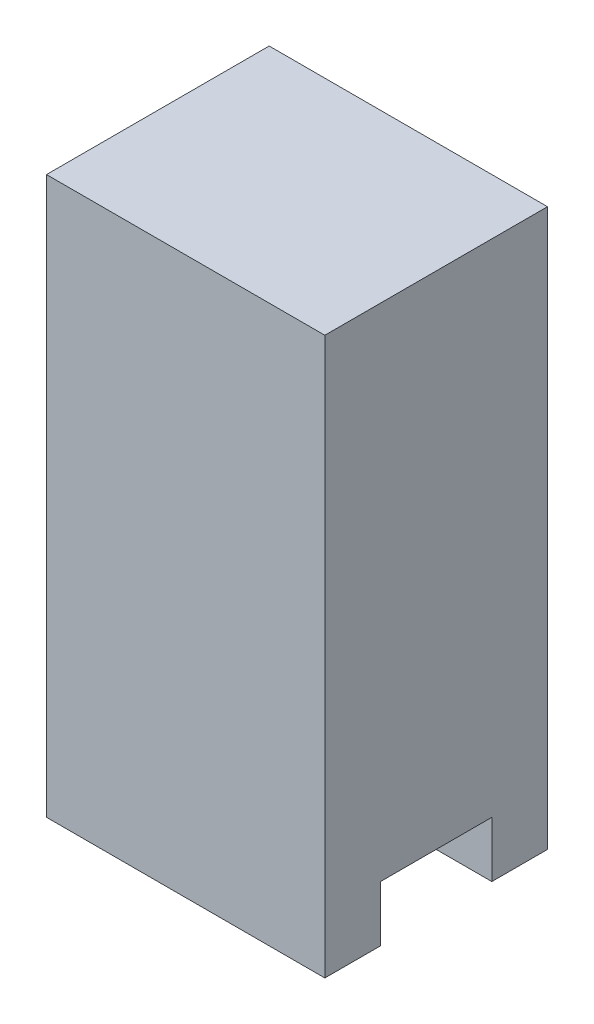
from build123d import *

# Parameters (mm, degrees)
ESQUISSE1_W             = 50
ESQUISSE1_H             = 100
BASE_EXTRUSION_DEPTH    = 40
ESQUISSE2_W             = 50
ESQUISSE2_H             = 20
ENL_V_MAT_EXTRU_1_DEPTH = 10


with BuildPart() as part:
    # Esquisse1 → Base-Extrusion (new body)
    with BuildSketch(Plane.XY):
        with Locations((25, 50)):
            Rectangle(ESQUISSE1_W, ESQUISSE1_H)
    extrude(amount=BASE_EXTRUSION_DEPTH)

    # Esquisse2 → Enl_v. mat.-Extru.1 (cut)
    with BuildSketch(Plane.XZ):
        with Locations((25, 20)):
            Rectangle(ESQUISSE2_W, ESQUISSE2_H)
    extrude(amount=-ENL_V_MAT_EXTRU_1_DEPTH, mode=Mode.SUBTRACT)


solid = part.part
